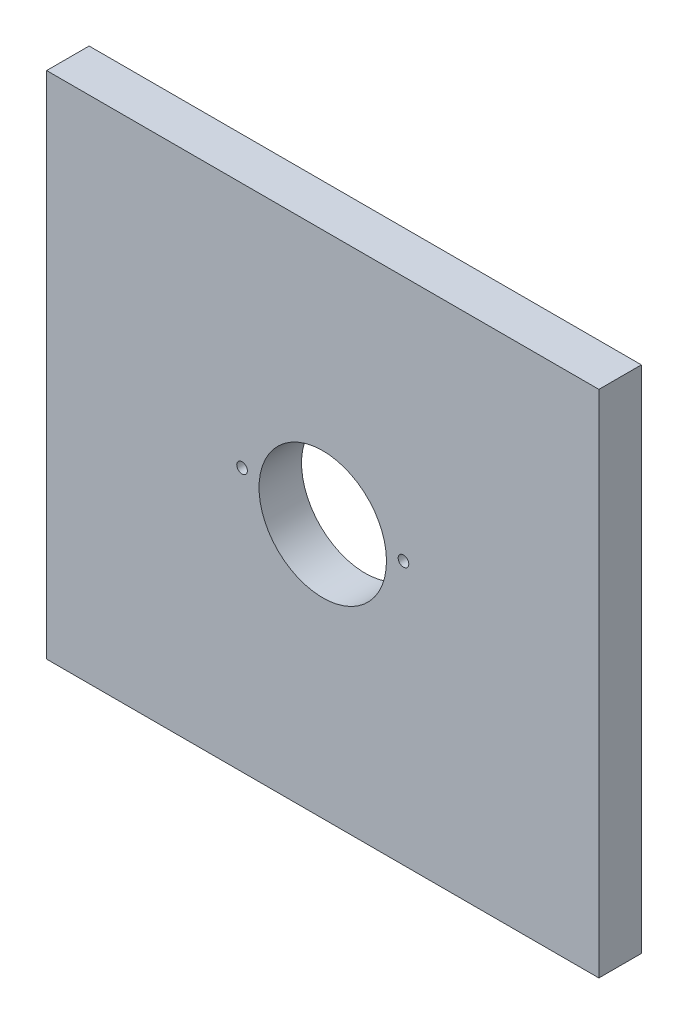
ISO-10303-21;
HEADER;
FILE_DESCRIPTION(('STEP AP214'),'2;1');
FILE_NAME('part.step','',(''),(''),'','','');
FILE_SCHEMA(('AUTOMOTIVE_DESIGN { 1 0 10303 214 1 1 1 1 }'));
ENDSEC;
DATA;
#1=APPLICATION_CONTEXT('core data for automotive mechanical design processes');
#2=APPLICATION_PROTOCOL_DEFINITION('international standard','automotive_design',2000,#1);
#3=PRODUCT_CONTEXT('',#1,'mechanical');
#4=PRODUCT('Part','Part','',(#3));
#5=PRODUCT_RELATED_PRODUCT_CATEGORY('part','',(#4));
#6=PRODUCT_DEFINITION_FORMATION('','',#4);
#7=PRODUCT_DEFINITION_CONTEXT('part definition',#1,'design');
#8=PRODUCT_DEFINITION('design','',#6,#7);
#9=PRODUCT_DEFINITION_SHAPE('','',#8);
#10=(LENGTH_UNIT() NAMED_UNIT(*) SI_UNIT(.MILLI.,.METRE.));
#11=(NAMED_UNIT(*) PLANE_ANGLE_UNIT() SI_UNIT($,.RADIAN.));
#12=(NAMED_UNIT(*) SI_UNIT($,.STERADIAN.) SOLID_ANGLE_UNIT());
#13=UNCERTAINTY_MEASURE_WITH_UNIT(LENGTH_MEASURE(1.E-05),#10,'distance_accuracy_value','');
#14=(GEOMETRIC_REPRESENTATION_CONTEXT(3) GLOBAL_UNCERTAINTY_ASSIGNED_CONTEXT((#13)) GLOBAL_UNIT_ASSIGNED_CONTEXT((#10,
#11,#12)) REPRESENTATION_CONTEXT('',''));
#15=CARTESIAN_POINT('',(0.,0.,0.));
#16=DIRECTION('',(0.,0.,1.));
#17=DIRECTION('',(1.,0.,0.));
#18=AXIS2_PLACEMENT_3D('',#15,#16,#17);
#19=CARTESIAN_POINT('',(-70.9009581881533,-120.,10.));
#20=DIRECTION('',(0.,0.,1.));
#21=DIRECTION('',(1.,0.,0.));
#22=AXIS2_PLACEMENT_3D('',#19,#20,#21);
#23=PLANE('',#22);
#24=CARTESIAN_POINT('',(13.0990418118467,-58.,10.));
#25=DIRECTION('',(0.,0.,1.));
#26=DIRECTION('',(1.,0.,0.));
#27=AXIS2_PLACEMENT_3D('',#24,#25,#26);
#28=CIRCLE('',#27,1.25);
#29=CARTESIAN_POINT('',(14.3490418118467,-58.,10.));
#30=VERTEX_POINT('',#29);
#31=EDGE_CURVE('E139',#30,#30,#28,.T.);
#32=ORIENTED_EDGE('',*,*,#31,.F.);
#33=EDGE_LOOP('',(#32));
#34=FACE_BOUND('',#33,.T.);
#35=CARTESIAN_POINT('',(-24.9009581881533,-58.,10.));
#36=DIRECTION('',(0.,0.,1.));
#37=DIRECTION('',(1.,0.,0.));
#38=AXIS2_PLACEMENT_3D('',#35,#36,#37);
#39=CIRCLE('',#38,1.25);
#40=CARTESIAN_POINT('',(-23.6509581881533,-58.,10.));
#41=VERTEX_POINT('',#40);
#42=EDGE_CURVE('E131',#41,#41,#39,.T.);
#43=ORIENTED_EDGE('',*,*,#42,.F.);
#44=EDGE_LOOP('',(#43));
#45=FACE_BOUND('',#44,.T.);
#46=DIRECTION('',(0.,-1.,0.));
#47=VECTOR('',#46,1.);
#48=CARTESIAN_POINT('',(-70.9009581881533,0.,10.));
#49=LINE('',#48,#47);
#50=CARTESIAN_POINT('',(-70.9009581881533,0.,10.));
#51=VERTEX_POINT('',#50);
#52=CARTESIAN_POINT('',(-70.9009581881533,-120.,10.));
#53=VERTEX_POINT('',#52);
#54=EDGE_CURVE('E104',#51,#53,#49,.T.);
#55=ORIENTED_EDGE('',*,*,#54,.T.);
#56=DIRECTION('',(1.,0.,0.));
#57=VECTOR('',#56,1.);
#58=CARTESIAN_POINT('',(-70.9009581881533,-120.,10.));
#59=LINE('',#58,#57);
#60=CARTESIAN_POINT('',(59.0990418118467,-120.,10.));
#61=VERTEX_POINT('',#60);
#62=EDGE_CURVE('E89',#53,#61,#59,.T.);
#63=ORIENTED_EDGE('',*,*,#62,.T.);
#64=DIRECTION('',(0.,1.,0.));
#65=VECTOR('',#64,1.);
#66=CARTESIAN_POINT('',(59.0990418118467,0.,10.));
#67=LINE('',#66,#65);
#68=CARTESIAN_POINT('',(59.0990418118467,0.,10.));
#69=VERTEX_POINT('',#68);
#70=EDGE_CURVE('E55',#61,#69,#67,.T.);
#71=ORIENTED_EDGE('',*,*,#70,.T.);
#72=DIRECTION('',(-1.,0.,0.));
#73=VECTOR('',#72,1.);
#74=CARTESIAN_POINT('',(-70.9009581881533,0.,10.));
#75=LINE('',#74,#73);
#76=EDGE_CURVE('E50',#69,#51,#75,.T.);
#77=ORIENTED_EDGE('',*,*,#76,.T.);
#78=EDGE_LOOP('',(#55,#63,#71,#77));
#79=FACE_BOUND('',#78,.T.);
#80=CARTESIAN_POINT('',(-5.90095818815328,-60.,10.));
#81=DIRECTION('',(0.,0.,1.));
#82=DIRECTION('',(1.,0.,0.));
#83=AXIS2_PLACEMENT_3D('',#80,#81,#82);
#84=CIRCLE('',#83,15.);
#85=CARTESIAN_POINT('',(9.09904181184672,-60.,10.));
#86=VERTEX_POINT('',#85);
#87=EDGE_CURVE('E94',#86,#86,#84,.T.);
#88=ORIENTED_EDGE('',*,*,#87,.F.);
#89=EDGE_LOOP('',(#88));
#90=FACE_BOUND('',#89,.T.);
#91=ADVANCED_FACE('F35',(#34,#45,#79,#90),#23,.T.);
#92=CARTESIAN_POINT('',(-70.9009581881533,-120.,0.));
#93=DIRECTION('',(0.,0.,1.));
#94=DIRECTION('',(1.,0.,0.));
#95=AXIS2_PLACEMENT_3D('',#92,#93,#94);
#96=PLANE('',#95);
#97=CARTESIAN_POINT('',(13.0990418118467,-58.,0.));
#98=DIRECTION('',(0.,0.,1.));
#99=DIRECTION('',(1.,0.,0.));
#100=AXIS2_PLACEMENT_3D('',#97,#98,#99);
#101=CIRCLE('',#100,1.25);
#102=CARTESIAN_POINT('',(14.3490418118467,-58.,0.));
#103=VERTEX_POINT('',#102);
#104=EDGE_CURVE('E136',#103,#103,#101,.T.);
#105=ORIENTED_EDGE('',*,*,#104,.T.);
#106=EDGE_LOOP('',(#105));
#107=FACE_BOUND('',#106,.T.);
#108=CARTESIAN_POINT('',(-24.9009581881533,-58.,0.));
#109=DIRECTION('',(0.,0.,1.));
#110=DIRECTION('',(1.,0.,0.));
#111=AXIS2_PLACEMENT_3D('',#108,#109,#110);
#112=CIRCLE('',#111,1.25);
#113=CARTESIAN_POINT('',(-23.6509581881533,-58.,0.));
#114=VERTEX_POINT('',#113);
#115=EDGE_CURVE('E129',#114,#114,#112,.T.);
#116=ORIENTED_EDGE('',*,*,#115,.T.);
#117=EDGE_LOOP('',(#116));
#118=FACE_BOUND('',#117,.T.);
#119=DIRECTION('',(0.,-1.,0.));
#120=VECTOR('',#119,1.);
#121=CARTESIAN_POINT('',(-70.9009581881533,0.,0.));
#122=LINE('',#121,#120);
#123=CARTESIAN_POINT('',(-70.9009581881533,0.,0.));
#124=VERTEX_POINT('',#123);
#125=CARTESIAN_POINT('',(-70.9009581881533,-120.,0.));
#126=VERTEX_POINT('',#125);
#127=EDGE_CURVE('E81',#124,#126,#122,.T.);
#128=ORIENTED_EDGE('',*,*,#127,.F.);
#129=DIRECTION('',(-1.,0.,0.));
#130=VECTOR('',#129,1.);
#131=CARTESIAN_POINT('',(-70.9009581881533,0.,0.));
#132=LINE('',#131,#130);
#133=CARTESIAN_POINT('',(59.0990418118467,0.,0.));
#134=VERTEX_POINT('',#133);
#135=EDGE_CURVE('E102',#134,#124,#132,.T.);
#136=ORIENTED_EDGE('',*,*,#135,.F.);
#137=DIRECTION('',(0.,1.,0.));
#138=VECTOR('',#137,1.);
#139=CARTESIAN_POINT('',(59.0990418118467,0.,0.));
#140=LINE('',#139,#138);
#141=CARTESIAN_POINT('',(59.0990418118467,-120.,0.));
#142=VERTEX_POINT('',#141);
#143=EDGE_CURVE('E82',#142,#134,#140,.T.);
#144=ORIENTED_EDGE('',*,*,#143,.F.);
#145=DIRECTION('',(1.,0.,0.));
#146=VECTOR('',#145,1.);
#147=CARTESIAN_POINT('',(-70.9009581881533,-120.,0.));
#148=LINE('',#147,#146);
#149=EDGE_CURVE('E76',#126,#142,#148,.T.);
#150=ORIENTED_EDGE('',*,*,#149,.F.);
#151=EDGE_LOOP('',(#128,#136,#144,#150));
#152=FACE_BOUND('',#151,.T.);
#153=CARTESIAN_POINT('',(-5.90095818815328,-60.,0.));
#154=DIRECTION('',(0.,0.,1.));
#155=DIRECTION('',(1.,0.,0.));
#156=AXIS2_PLACEMENT_3D('',#153,#154,#155);
#157=CIRCLE('',#156,15.);
#158=CARTESIAN_POINT('',(9.09904181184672,-60.,0.));
#159=VERTEX_POINT('',#158);
#160=EDGE_CURVE('E97',#159,#159,#157,.T.);
#161=ORIENTED_EDGE('',*,*,#160,.T.);
#162=EDGE_LOOP('',(#161));
#163=FACE_BOUND('',#162,.T.);
#164=ADVANCED_FACE('F77',(#107,#118,#152,#163),#96,.F.);
#165=CARTESIAN_POINT('',(-70.9009581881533,0.,10.));
#166=DIRECTION('',(1.,0.,0.));
#167=DIRECTION('',(0.,1.,0.));
#168=AXIS2_PLACEMENT_3D('',#165,#166,#167);
#169=PLANE('',#168);
#170=ORIENTED_EDGE('',*,*,#127,.T.);
#171=DIRECTION('',(0.,0.,-1.));
#172=VECTOR('',#171,1.);
#173=CARTESIAN_POINT('',(-70.9009581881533,-120.,10.));
#174=LINE('',#173,#172);
#175=EDGE_CURVE('E11',#53,#126,#174,.T.);
#176=ORIENTED_EDGE('',*,*,#175,.F.);
#177=ORIENTED_EDGE('',*,*,#54,.F.);
#178=DIRECTION('',(0.,0.,-1.));
#179=VECTOR('',#178,1.);
#180=CARTESIAN_POINT('',(-70.9009581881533,0.,10.));
#181=LINE('',#180,#179);
#182=EDGE_CURVE('E93',#51,#124,#181,.T.);
#183=ORIENTED_EDGE('',*,*,#182,.T.);
#184=EDGE_LOOP('',(#170,#176,#177,#183));
#185=FACE_BOUND('',#184,.T.);
#186=ADVANCED_FACE('F37',(#185),#169,.F.);
#187=CARTESIAN_POINT('',(-70.9009581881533,-120.,10.));
#188=DIRECTION('',(0.,1.,0.));
#189=DIRECTION('',(0.,0.,1.));
#190=AXIS2_PLACEMENT_3D('',#187,#188,#189);
#191=PLANE('',#190);
#192=ORIENTED_EDGE('',*,*,#149,.T.);
#193=DIRECTION('',(0.,0.,-1.));
#194=VECTOR('',#193,1.);
#195=CARTESIAN_POINT('',(59.0990418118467,-120.,10.));
#196=LINE('',#195,#194);
#197=EDGE_CURVE('E43',#61,#142,#196,.T.);
#198=ORIENTED_EDGE('',*,*,#197,.F.);
#199=ORIENTED_EDGE('',*,*,#62,.F.);
#200=ORIENTED_EDGE('',*,*,#175,.T.);
#201=EDGE_LOOP('',(#192,#198,#199,#200));
#202=FACE_BOUND('',#201,.T.);
#203=ADVANCED_FACE('F88',(#202),#191,.F.);
#204=CARTESIAN_POINT('',(59.0990418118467,0.,10.));
#205=DIRECTION('',(-1.,0.,0.));
#206=DIRECTION('',(0.,-1.,0.));
#207=AXIS2_PLACEMENT_3D('',#204,#205,#206);
#208=PLANE('',#207);
#209=ORIENTED_EDGE('',*,*,#143,.T.);
#210=DIRECTION('',(0.,0.,-1.));
#211=VECTOR('',#210,1.);
#212=CARTESIAN_POINT('',(59.0990418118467,0.,10.));
#213=LINE('',#212,#211);
#214=EDGE_CURVE('E110',#69,#134,#213,.T.);
#215=ORIENTED_EDGE('',*,*,#214,.F.);
#216=ORIENTED_EDGE('',*,*,#70,.F.);
#217=ORIENTED_EDGE('',*,*,#197,.T.);
#218=EDGE_LOOP('',(#209,#215,#216,#217));
#219=FACE_BOUND('',#218,.T.);
#220=ADVANCED_FACE('F113',(#219),#208,.F.);
#221=CARTESIAN_POINT('',(-70.9009581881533,0.,10.));
#222=DIRECTION('',(0.,-1.,0.));
#223=DIRECTION('',(1.,0.,0.));
#224=AXIS2_PLACEMENT_3D('',#221,#222,#223);
#225=PLANE('',#224);
#226=ORIENTED_EDGE('',*,*,#135,.T.);
#227=ORIENTED_EDGE('',*,*,#182,.F.);
#228=ORIENTED_EDGE('',*,*,#76,.F.);
#229=ORIENTED_EDGE('',*,*,#214,.T.);
#230=EDGE_LOOP('',(#226,#227,#228,#229));
#231=FACE_BOUND('',#230,.T.);
#232=ADVANCED_FACE('F115',(#231),#225,.F.);
#233=CARTESIAN_POINT('',(-5.90095818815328,-60.,10.));
#234=DIRECTION('',(0.,0.,-1.));
#235=DIRECTION('',(-1.,0.,0.));
#236=AXIS2_PLACEMENT_3D('',#233,#234,#235);
#237=CYLINDRICAL_SURFACE('',#236,15.);
#238=ORIENTED_EDGE('',*,*,#87,.T.);
#239=EDGE_LOOP('',(#238));
#240=FACE_BOUND('',#239,.T.);
#241=ORIENTED_EDGE('',*,*,#160,.F.);
#242=EDGE_LOOP('',(#241));
#243=FACE_BOUND('',#242,.T.);
#244=ADVANCED_FACE('F122',(#240,#243),#237,.F.);
#245=CARTESIAN_POINT('',(-24.9009581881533,-58.,0.));
#246=DIRECTION('',(0.,0.,1.));
#247=DIRECTION('',(1.,0.,0.));
#248=AXIS2_PLACEMENT_3D('',#245,#246,#247);
#249=CYLINDRICAL_SURFACE('',#248,1.25);
#250=ORIENTED_EDGE('',*,*,#115,.F.);
#251=EDGE_LOOP('',(#250));
#252=FACE_BOUND('',#251,.T.);
#253=ORIENTED_EDGE('',*,*,#42,.T.);
#254=EDGE_LOOP('',(#253));
#255=FACE_BOUND('',#254,.T.);
#256=ADVANCED_FACE('F125',(#252,#255),#249,.F.);
#257=CARTESIAN_POINT('',(13.0990418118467,-58.,0.));
#258=DIRECTION('',(0.,0.,1.));
#259=DIRECTION('',(1.,0.,0.));
#260=AXIS2_PLACEMENT_3D('',#257,#258,#259);
#261=CYLINDRICAL_SURFACE('',#260,1.25);
#262=ORIENTED_EDGE('',*,*,#104,.F.);
#263=EDGE_LOOP('',(#262));
#264=FACE_BOUND('',#263,.T.);
#265=ORIENTED_EDGE('',*,*,#31,.T.);
#266=EDGE_LOOP('',(#265));
#267=FACE_BOUND('',#266,.T.);
#268=ADVANCED_FACE('F143',(#264,#267),#261,.F.);
#269=CLOSED_SHELL('',(#91,#164,#186,#203,#220,#232,#244,#256,#268));
#270=MANIFOLD_SOLID_BREP('B2',#269);
#271=ADVANCED_BREP_SHAPE_REPRESENTATION('',(#18,#270),#14);
#272=SHAPE_DEFINITION_REPRESENTATION(#9,#271);
ENDSEC;
END-ISO-10303-21;
